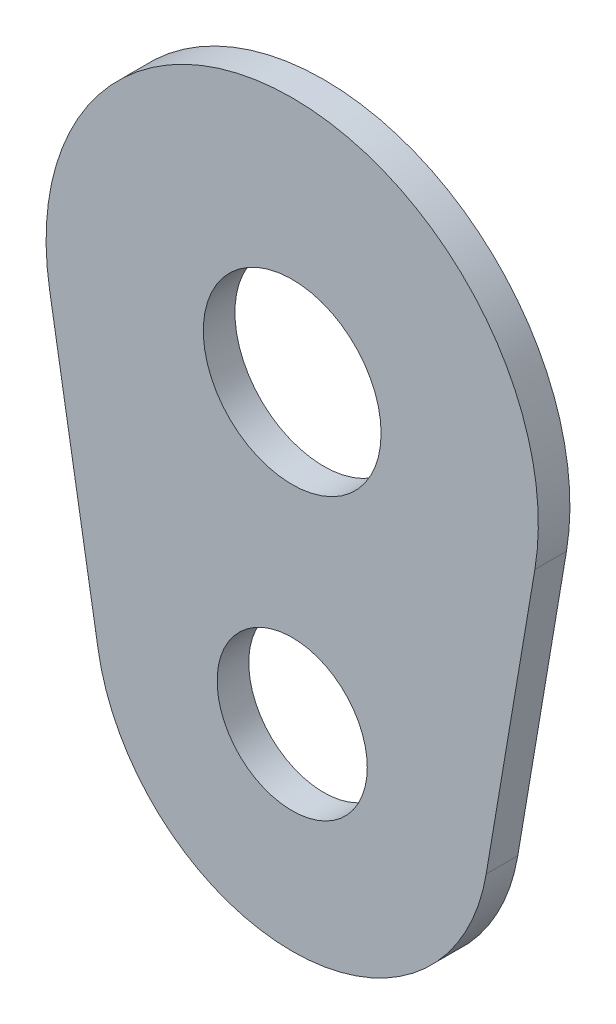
from build123d import *

# Parameters (mm, degrees)
EXTRUDE1_DEPTH     = 2.032
SKETCH2_R          = 4.826
CUT_EXTRUDE1_DEPTH = 36.484914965
SKETCH3_R          = 5.715
CUT_EXTRUDE2_DEPTH = 36.484914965


with BuildPart() as part:
    # Sketch1 → Extrude1 (new body)
    with BuildSketch(Plane.XY):
        with BuildLine():
            Line((-15.60085462, -2.637025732), (-12.470262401, -21.157859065))
            ThreePointArc((-12.470262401, -21.157859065), (0, -31.697154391), (12.470262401, -21.157859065))
            Line((12.470262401, -21.157859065), (15.60085462, -2.637025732))
            ThreePointArc((15.60085462, -2.637025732), (0, 15.822154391), (-15.60085462, -2.637025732))
        make_face()
    extrude(amount=EXTRUDE1_DEPTH)

    # Sketch2 → Cut-Extrude1 (cut, through all)
    with BuildSketch(Plane.XY.offset(2.032)):
        with Locations((0, -19.05)):
            Circle(SKETCH2_R)
    extrude(amount=-CUT_EXTRUDE1_DEPTH, mode=Mode.SUBTRACT)

    # Sketch3 → Cut-Extrude2 (cut, through all)
    with BuildSketch(Plane.XY.offset(2.032)):
        Circle(SKETCH3_R)
    extrude(amount=-CUT_EXTRUDE2_DEPTH, mode=Mode.SUBTRACT)


solid = part.part
